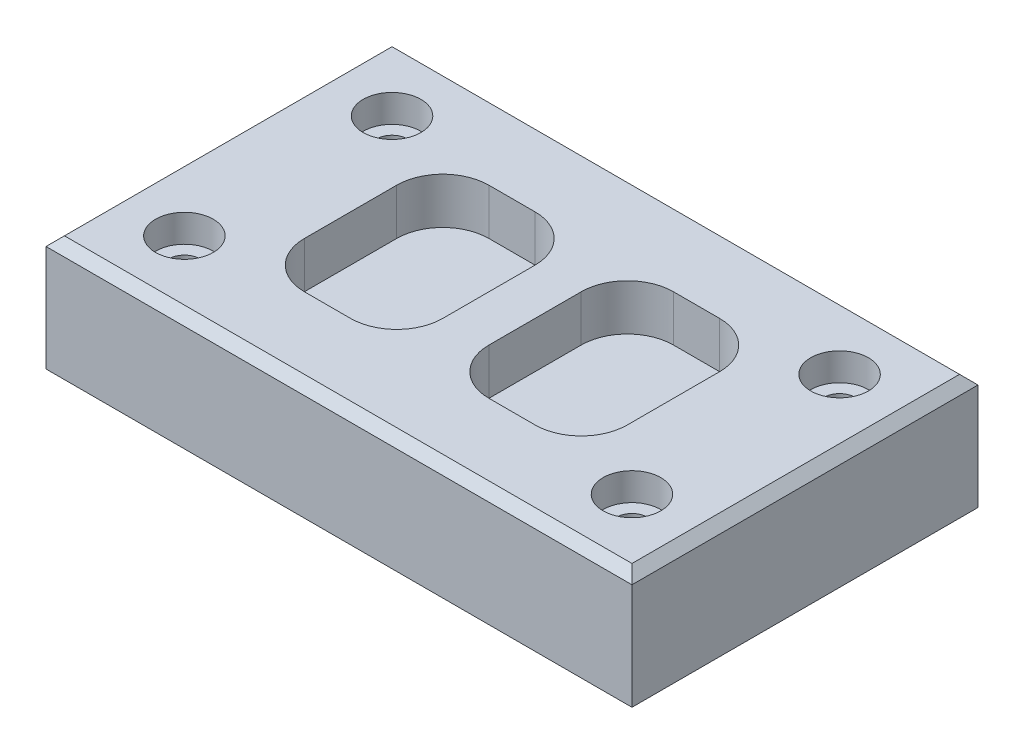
from build123d import *

# Parameters (mm, degrees)
SKETCH1_W           = 254
SKETCH1_H           = 150
BOSS_EXTRUDE1_DEPTH = 50
CUT_EXTRUDE1_DEPTH  = 20
CBORE_D             = 13.5
CBORE_CBORE_D       = 25
CBORE_CBORE_DEPTH   = 12
CHAMFER1_SIZE       = 4


with BuildPart() as part:
    # Sketch1 → Boss-Extrude1 (new body)
    with BuildSketch(Plane(origin=(0, 0, 0), x_dir=(1, 0, 0), z_dir=(0, 1, 0))):
        Rectangle(SKETCH1_W, SKETCH1_H)
    extrude(amount=BOSS_EXTRUDE1_DEPTH)

    # Sketch2 → Cut-Extrude1 (cut)
    with BuildSketch(Plane(origin=(0, 50, 0), x_dir=(1, 0, 0), z_dir=(0, 1, 0))):
        with BuildLine():
            Line((-70, -20), (-70, 20))
            ThreePointArc((-70, 20), (-64.142135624, 34.142135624), (-50, 40))
            Line((-50, 40), (-30, 40))
            ThreePointArc((-30, 40), (-15.857864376, 34.142135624), (-10, 20))
            Line((-10, 20), (-10, -20))
            ThreePointArc((-10, -20), (-15.857864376, -34.142135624), (-30, -40))
            Line((-30, -40), (-50, -40))
            ThreePointArc((-50, -40), (-64.142135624, -34.142135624), (-70, -20))
        make_face()
        with BuildLine():
            Line((50, 40), (30, 40))
            ThreePointArc((30, 40), (15.857864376, 34.142135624), (10, 20))
            Line((10, 20), (10, -20))
            ThreePointArc((10, -20), (15.857864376, -34.142135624), (30, -40))
            Line((30, -40), (50, -40))
            ThreePointArc((50, -40), (64.142135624, -34.142135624), (70, -20))
            Line((70, -20), (70, 20))
            ThreePointArc((70, 20), (64.142135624, 34.142135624), (50, 40))
        make_face()
    extrude(amount=-CUT_EXTRUDE1_DEPTH, mode=Mode.SUBTRACT)

    # CBORE (through all)
    with Locations(Plane(origin=(0, 50, 0), x_dir=(1, 0, 0), z_dir=(0, 1, 0))):
        with Locations((-97, -45), (-97, 45), (97, 45), (97, -45)):
            CounterBoreHole(CBORE_D / 2, CBORE_CBORE_D / 2, CBORE_CBORE_DEPTH)

    # Chamfer1
    chamfer1_edges = [part.edges().sort_by_distance(p)[0] for p in [
        (127, 50, 0),
        (0, 50, -75),
        (-127, 50, 0),
        (0, 50, 75),
    ]]
    chamfer(chamfer1_edges, length=CHAMFER1_SIZE)


solid = part.part
